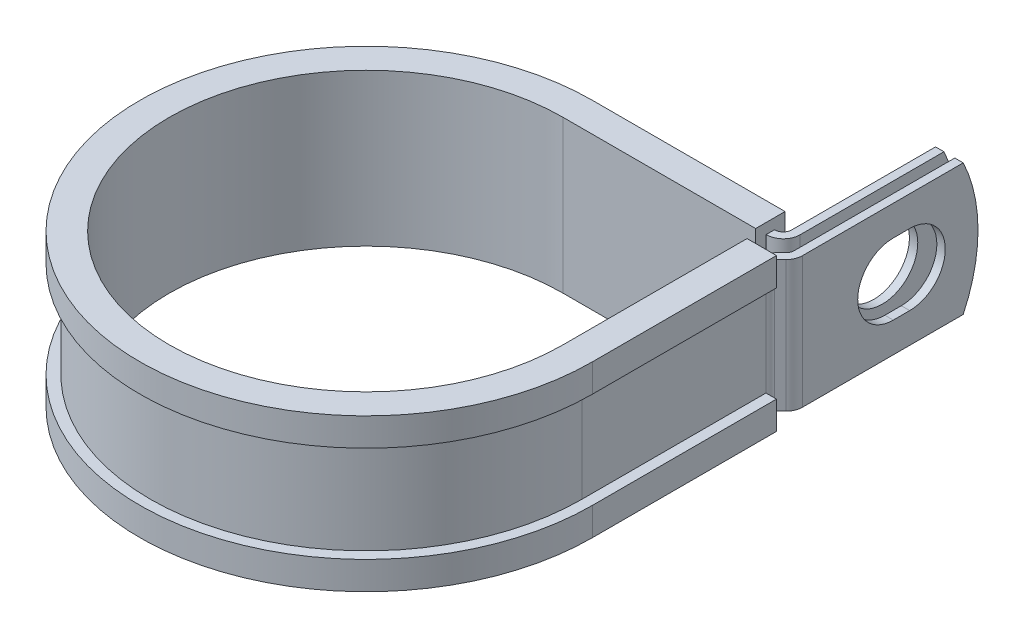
ISO-10303-21;
HEADER;
FILE_DESCRIPTION(('STEP AP214'),'2;1');
FILE_NAME('part.step','',(''),(''),'','','');
FILE_SCHEMA(('AUTOMOTIVE_DESIGN { 1 0 10303 214 1 1 1 1 }'));
ENDSEC;
DATA;
#1=APPLICATION_CONTEXT('core data for automotive mechanical design processes');
#2=APPLICATION_PROTOCOL_DEFINITION('international standard','automotive_design',2000,#1);
#3=PRODUCT_CONTEXT('',#1,'mechanical');
#4=PRODUCT('Part','Part','',(#3));
#5=PRODUCT_RELATED_PRODUCT_CATEGORY('part','',(#4));
#6=PRODUCT_DEFINITION_FORMATION('','',#4);
#7=PRODUCT_DEFINITION_CONTEXT('part definition',#1,'design');
#8=PRODUCT_DEFINITION('design','',#6,#7);
#9=PRODUCT_DEFINITION_SHAPE('','',#8);
#10=(LENGTH_UNIT() NAMED_UNIT(*) SI_UNIT(.MILLI.,.METRE.));
#11=(NAMED_UNIT(*) PLANE_ANGLE_UNIT() SI_UNIT($,.RADIAN.));
#12=(NAMED_UNIT(*) SI_UNIT($,.STERADIAN.) SOLID_ANGLE_UNIT());
#13=UNCERTAINTY_MEASURE_WITH_UNIT(LENGTH_MEASURE(1.E-05),#10,'distance_accuracy_value','');
#14=(GEOMETRIC_REPRESENTATION_CONTEXT(3) GLOBAL_UNCERTAINTY_ASSIGNED_CONTEXT((#13)) GLOBAL_UNIT_ASSIGNED_CONTEXT((#10,
#11,#12)) REPRESENTATION_CONTEXT('',''));
#15=CARTESIAN_POINT('',(0.,0.,0.));
#16=DIRECTION('',(0.,0.,1.));
#17=DIRECTION('',(1.,0.,0.));
#18=AXIS2_PLACEMENT_3D('',#15,#16,#17);
#19=CARTESIAN_POINT('',(30.7772698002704,-9.525,-30.099));
#20=DIRECTION('',(0.,1.,0.));
#21=DIRECTION('',(1.,0.,0.));
#22=AXIS2_PLACEMENT_3D('',#19,#20,#21);
#23=PLANE('',#22);
#24=DIRECTION('',(0.,0.,-1.));
#25=VECTOR('',#24,1.);
#26=CARTESIAN_POINT('',(27.9324698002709,-9.525,-30.099));
#27=LINE('',#26,#25);
#28=CARTESIAN_POINT('',(27.9324698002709,-9.525,-30.099));
#29=VERTEX_POINT('',#28);
#30=CARTESIAN_POINT('',(27.9324698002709,-9.525,-31.3182));
#31=VERTEX_POINT('',#30);
#32=EDGE_CURVE('E524',#29,#31,#27,.T.);
#33=ORIENTED_EDGE('',*,*,#32,.T.);
#34=DIRECTION('',(1.,0.,0.));
#35=VECTOR('',#34,1.);
#36=CARTESIAN_POINT('',(0.,-9.525,-31.3182));
#37=LINE('',#36,#35);
#38=CARTESIAN_POINT('',(27.9832698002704,-9.525,-31.3182));
#39=VERTEX_POINT('',#38);
#40=EDGE_CURVE('E411',#39,#31,#37,.F.);
#41=ORIENTED_EDGE('',*,*,#40,.F.);
#42=CARTESIAN_POINT('',(27.9832698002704,-9.525,-32.5374));
#43=DIRECTION('',(0.,1.,0.));
#44=DIRECTION('',(1.,0.,0.));
#45=AXIS2_PLACEMENT_3D('',#42,#43,#44);
#46=CIRCLE('',#45,1.2192);
#47=CARTESIAN_POINT('',(29.2024698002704,-9.525,-32.5374));
#48=VERTEX_POINT('',#47);
#49=EDGE_CURVE('E409',#48,#39,#46,.F.);
#50=ORIENTED_EDGE('',*,*,#49,.F.);
#51=DIRECTION('',(0.,0.,1.));
#52=VECTOR('',#51,1.);
#53=CARTESIAN_POINT('',(29.2024698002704,-9.525,-55.5498));
#54=LINE('',#53,#52);
#55=CARTESIAN_POINT('',(29.2024698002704,-9.525,-53.4052631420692));
#56=VERTEX_POINT('',#55);
#57=EDGE_CURVE('E407',#56,#48,#54,.T.);
#58=ORIENTED_EDGE('',*,*,#57,.F.);
#59=DIRECTION('',(-1.,0.,0.));
#60=VECTOR('',#59,1.);
#61=CARTESIAN_POINT('',(33.2156698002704,-9.525,-53.4052631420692));
#62=LINE('',#61,#60);
#63=CARTESIAN_POINT('',(30.4216698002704,-9.525,-53.4052631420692));
#64=VERTEX_POINT('',#63);
#65=EDGE_CURVE('E12',#64,#56,#62,.T.);
#66=ORIENTED_EDGE('',*,*,#65,.F.);
#67=DIRECTION('',(0.,0.,1.));
#68=VECTOR('',#67,1.);
#69=CARTESIAN_POINT('',(30.4216698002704,-9.525,-55.5498));
#70=LINE('',#69,#68);
#71=CARTESIAN_POINT('',(30.4216698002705,-9.525,-32.5374));
#72=VERTEX_POINT('',#71);
#73=EDGE_CURVE('E405',#64,#72,#70,.T.);
#74=ORIENTED_EDGE('',*,*,#73,.T.);
#75=CARTESIAN_POINT('',(27.9832698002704,-9.525,-32.5374));
#76=DIRECTION('',(0.,-1.,0.));
#77=DIRECTION('',(0.,0.,1.));
#78=AXIS2_PLACEMENT_3D('',#75,#76,#77);
#79=CIRCLE('',#78,2.4384);
#80=CARTESIAN_POINT('',(27.9832698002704,-9.525,-30.099));
#81=VERTEX_POINT('',#80);
#82=EDGE_CURVE('E402',#72,#81,#79,.T.);
#83=ORIENTED_EDGE('',*,*,#82,.T.);
#84=DIRECTION('',(-1.,0.,0.));
#85=VECTOR('',#84,1.);
#86=CARTESIAN_POINT('',(0.,-9.525,-30.099));
#87=LINE('',#86,#85);
#88=EDGE_CURVE('E399',#81,#29,#87,.T.);
#89=ORIENTED_EDGE('',*,*,#88,.T.);
#90=EDGE_LOOP('',(#33,#41,#50,#58,#66,#74,#83,#89));
#91=FACE_BOUND('',#90,.T.);
#92=ADVANCED_FACE('F55',(#91),#23,.F.);
#93=CARTESIAN_POINT('',(30.7772698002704,9.525,-30.099));
#94=DIRECTION('',(0.,1.,0.));
#95=DIRECTION('',(1.,0.,0.));
#96=AXIS2_PLACEMENT_3D('',#93,#94,#95);
#97=PLANE('',#96);
#98=DIRECTION('',(1.,0.,0.));
#99=VECTOR('',#98,1.);
#100=CARTESIAN_POINT('',(0.,9.525,-31.3182));
#101=LINE('',#100,#99);
#102=CARTESIAN_POINT('',(27.9832698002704,9.525,-31.3182));
#103=VERTEX_POINT('',#102);
#104=CARTESIAN_POINT('',(27.9324698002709,9.525,-31.3182));
#105=VERTEX_POINT('',#104);
#106=EDGE_CURVE('E369',#103,#105,#101,.F.);
#107=ORIENTED_EDGE('',*,*,#106,.T.);
#108=DIRECTION('',(0.,0.,1.));
#109=VECTOR('',#108,1.);
#110=CARTESIAN_POINT('',(27.9324698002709,9.525,-31.3182));
#111=LINE('',#110,#109);
#112=CARTESIAN_POINT('',(27.9324698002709,9.525,-30.099));
#113=VERTEX_POINT('',#112);
#114=EDGE_CURVE('E518',#105,#113,#111,.T.);
#115=ORIENTED_EDGE('',*,*,#114,.T.);
#116=DIRECTION('',(-1.,0.,0.));
#117=VECTOR('',#116,1.);
#118=CARTESIAN_POINT('',(0.,9.525,-30.099));
#119=LINE('',#118,#117);
#120=CARTESIAN_POINT('',(27.9832698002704,9.525,-30.099));
#121=VERTEX_POINT('',#120);
#122=EDGE_CURVE('E626',#121,#113,#119,.T.);
#123=ORIENTED_EDGE('',*,*,#122,.F.);
#124=CARTESIAN_POINT('',(27.9832698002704,9.525,-32.5374));
#125=DIRECTION('',(0.,-1.,0.));
#126=DIRECTION('',(0.,0.,1.));
#127=AXIS2_PLACEMENT_3D('',#124,#125,#126);
#128=CIRCLE('',#127,2.4384);
#129=CARTESIAN_POINT('',(30.4216698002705,9.525,-32.5374));
#130=VERTEX_POINT('',#129);
#131=EDGE_CURVE('E371',#130,#121,#128,.T.);
#132=ORIENTED_EDGE('',*,*,#131,.F.);
#133=DIRECTION('',(0.,0.,1.));
#134=VECTOR('',#133,1.);
#135=CARTESIAN_POINT('',(30.4216698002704,9.525,-55.5498));
#136=LINE('',#135,#134);
#137=CARTESIAN_POINT('',(30.4216698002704,9.525,-53.4052631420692));
#138=VERTEX_POINT('',#137);
#139=EDGE_CURVE('E362',#138,#130,#136,.T.);
#140=ORIENTED_EDGE('',*,*,#139,.F.);
#141=DIRECTION('',(-1.,0.,0.));
#142=VECTOR('',#141,1.);
#143=CARTESIAN_POINT('',(33.2156698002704,9.525,-53.4052631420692));
#144=LINE('',#143,#142);
#145=CARTESIAN_POINT('',(29.2024698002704,9.525,-53.4052631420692));
#146=VERTEX_POINT('',#145);
#147=EDGE_CURVE('E63',#138,#146,#144,.T.);
#148=ORIENTED_EDGE('',*,*,#147,.T.);
#149=DIRECTION('',(0.,0.,1.));
#150=VECTOR('',#149,1.);
#151=CARTESIAN_POINT('',(29.2024698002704,9.525,-55.5498));
#152=LINE('',#151,#150);
#153=CARTESIAN_POINT('',(29.2024698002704,9.525,-32.5374));
#154=VERTEX_POINT('',#153);
#155=EDGE_CURVE('E359',#146,#154,#152,.T.);
#156=ORIENTED_EDGE('',*,*,#155,.T.);
#157=CARTESIAN_POINT('',(27.9832698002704,9.525,-32.5374));
#158=DIRECTION('',(0.,1.,0.));
#159=DIRECTION('',(1.,0.,0.));
#160=AXIS2_PLACEMENT_3D('',#157,#158,#159);
#161=CIRCLE('',#160,1.2192);
#162=EDGE_CURVE('E367',#154,#103,#161,.F.);
#163=ORIENTED_EDGE('',*,*,#162,.T.);
#164=EDGE_LOOP('',(#107,#115,#123,#132,#140,#148,#156,#163));
#165=FACE_BOUND('',#164,.T.);
#166=ADVANCED_FACE('F358',(#165),#97,.T.);
#167=CARTESIAN_POINT('',(0.,9.525,-30.099));
#168=DIRECTION('',(0.,0.,1.));
#169=DIRECTION('',(1.,0.,0.));
#170=AXIS2_PLACEMENT_3D('',#167,#168,#169);
#171=PLANE('',#170);
#172=ORIENTED_EDGE('',*,*,#122,.T.);
#173=DIRECTION('',(0.,-1.,0.));
#174=VECTOR('',#173,1.);
#175=CARTESIAN_POINT('',(27.9324698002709,9.525,-30.099));
#176=LINE('',#175,#174);
#177=EDGE_CURVE('E521',#113,#29,#176,.T.);
#178=ORIENTED_EDGE('',*,*,#177,.T.);
#179=ORIENTED_EDGE('',*,*,#88,.F.);
#180=DIRECTION('',(0.,-1.,0.));
#181=VECTOR('',#180,1.);
#182=CARTESIAN_POINT('',(27.9832698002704,9.525,-30.099));
#183=LINE('',#182,#181);
#184=EDGE_CURVE('E345',#121,#81,#183,.T.);
#185=ORIENTED_EDGE('',*,*,#184,.F.);
#186=EDGE_LOOP('',(#172,#178,#179,#185));
#187=FACE_BOUND('',#186,.T.);
#188=ADVANCED_FACE('F636',(#187),#171,.T.);
#189=CARTESIAN_POINT('',(33.2156698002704,9.525,-30.099));
#190=DIRECTION('',(-1.,0.,0.));
#191=DIRECTION('',(0.,0.,1.));
#192=AXIS2_PLACEMENT_3D('',#189,#190,#191);
#193=PLANE('',#192);
#194=CARTESIAN_POINT('',(33.2156698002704,0.,-45.6437999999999));
#195=DIRECTION('',(1.,0.,0.));
#196=DIRECTION('',(0.,0.,-1.));
#197=AXIS2_PLACEMENT_3D('',#194,#195,#196);
#198=CIRCLE('',#197,5.1562);
#199=CARTESIAN_POINT('',(33.2156698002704,-5.1562,-45.6438000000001));
#200=VERTEX_POINT('',#199);
#201=CARTESIAN_POINT('',(33.2156698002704,5.1562,-45.6438000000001));
#202=VERTEX_POINT('',#201);
#203=EDGE_CURVE('E581',#200,#202,#198,.T.);
#204=ORIENTED_EDGE('',*,*,#203,.F.);
#205=DIRECTION('',(0.,0.,-1.));
#206=VECTOR('',#205,1.);
#207=CARTESIAN_POINT('',(33.2156698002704,-5.1562,-43.2561999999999));
#208=LINE('',#207,#206);
#209=CARTESIAN_POINT('',(33.2156698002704,-5.1562,-43.2561999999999));
#210=VERTEX_POINT('',#209);
#211=EDGE_CURVE('E584',#210,#200,#208,.T.);
#212=ORIENTED_EDGE('',*,*,#211,.F.);
#213=CARTESIAN_POINT('',(33.2156698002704,0.,-43.2561999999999));
#214=DIRECTION('',(1.,0.,0.));
#215=DIRECTION('',(0.,0.,-1.));
#216=AXIS2_PLACEMENT_3D('',#213,#214,#215);
#217=CIRCLE('',#216,5.1562);
#218=CARTESIAN_POINT('',(33.2156698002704,5.1562,-43.2561999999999));
#219=VERTEX_POINT('',#218);
#220=EDGE_CURVE('E577',#219,#210,#217,.T.);
#221=ORIENTED_EDGE('',*,*,#220,.F.);
#222=DIRECTION('',(0.,0.,1.));
#223=VECTOR('',#222,1.);
#224=CARTESIAN_POINT('',(33.2156698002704,5.1562,-43.2561999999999));
#225=LINE('',#224,#223);
#226=EDGE_CURVE('E578',#202,#219,#225,.T.);
#227=ORIENTED_EDGE('',*,*,#226,.F.);
#228=EDGE_LOOP('',(#204,#212,#221,#227));
#229=FACE_BOUND('',#228,.T.);
#230=DIRECTION('',(0.,0.,-1.));
#231=VECTOR('',#230,1.);
#232=CARTESIAN_POINT('',(33.2156698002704,-9.525,-30.099));
#233=LINE('',#232,#231);
#234=CARTESIAN_POINT('',(33.2156698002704,-9.525,-30.099));
#235=VERTEX_POINT('',#234);
#236=CARTESIAN_POINT('',(33.2156698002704,-9.525,-53.4052631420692));
#237=VERTEX_POINT('',#236);
#238=EDGE_CURVE('E383',#235,#237,#233,.T.);
#239=ORIENTED_EDGE('',*,*,#238,.T.);
#240=CARTESIAN_POINT('',(33.2156698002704,0.,-33.3248));
#241=DIRECTION('',(-1.,0.,0.));
#242=DIRECTION('',(0.,0.,1.));
#243=AXIS2_PLACEMENT_3D('',#240,#241,#242);
#244=CIRCLE('',#243,22.225);
#245=CARTESIAN_POINT('',(33.2156698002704,9.525,-53.4052631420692));
#246=VERTEX_POINT('',#245);
#247=EDGE_CURVE('E569',#246,#237,#244,.T.);
#248=ORIENTED_EDGE('',*,*,#247,.F.);
#249=DIRECTION('',(0.,0.,-1.));
#250=VECTOR('',#249,1.);
#251=CARTESIAN_POINT('',(33.2156698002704,9.525,-30.099));
#252=LINE('',#251,#250);
#253=CARTESIAN_POINT('',(33.2156698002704,9.525,-30.099));
#254=VERTEX_POINT('',#253);
#255=EDGE_CURVE('E420',#254,#246,#252,.T.);
#256=ORIENTED_EDGE('',*,*,#255,.F.);
#257=DIRECTION('',(0.,-1.,0.));
#258=VECTOR('',#257,1.);
#259=CARTESIAN_POINT('',(33.2156698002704,9.525,-30.099));
#260=LINE('',#259,#258);
#261=EDGE_CURVE('E382',#254,#235,#260,.T.);
#262=ORIENTED_EDGE('',*,*,#261,.T.);
#263=EDGE_LOOP('',(#239,#248,#256,#262));
#264=FACE_BOUND('',#263,.T.);
#265=ADVANCED_FACE('F57',(#229,#264),#193,.F.);
#266=CARTESIAN_POINT('',(31.9964698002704,9.525,-30.099));
#267=DIRECTION('',(-1.,0.,0.));
#268=DIRECTION('',(0.,0.,1.));
#269=AXIS2_PLACEMENT_3D('',#266,#267,#268);
#270=PLANE('',#269);
#271=DIRECTION('',(0.,0.,-1.));
#272=VECTOR('',#271,1.);
#273=CARTESIAN_POINT('',(31.9964698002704,-5.1562,-43.2561999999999));
#274=LINE('',#273,#272);
#275=CARTESIAN_POINT('',(31.9964698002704,-5.1562,-43.2561999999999));
#276=VERTEX_POINT('',#275);
#277=CARTESIAN_POINT('',(31.9964698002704,-5.1562,-45.6438000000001));
#278=VERTEX_POINT('',#277);
#279=EDGE_CURVE('E580',#276,#278,#274,.T.);
#280=ORIENTED_EDGE('',*,*,#279,.T.);
#281=CARTESIAN_POINT('',(31.9964698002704,0.,-45.6437999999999));
#282=DIRECTION('',(-1.,0.,0.));
#283=DIRECTION('',(0.,0.,1.));
#284=AXIS2_PLACEMENT_3D('',#281,#282,#283);
#285=CIRCLE('',#284,5.1562);
#286=CARTESIAN_POINT('',(31.9964698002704,5.1562,-45.6438000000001));
#287=VERTEX_POINT('',#286);
#288=EDGE_CURVE('E601',#278,#287,#285,.F.);
#289=ORIENTED_EDGE('',*,*,#288,.T.);
#290=DIRECTION('',(0.,0.,1.));
#291=VECTOR('',#290,1.);
#292=CARTESIAN_POINT('',(31.9964698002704,5.1562,-43.2561999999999));
#293=LINE('',#292,#291);
#294=CARTESIAN_POINT('',(31.9964698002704,5.1562,-43.2561999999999));
#295=VERTEX_POINT('',#294);
#296=EDGE_CURVE('E597',#287,#295,#293,.T.);
#297=ORIENTED_EDGE('',*,*,#296,.T.);
#298=CARTESIAN_POINT('',(31.9964698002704,0.,-43.2561999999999));
#299=DIRECTION('',(-1.,0.,0.));
#300=DIRECTION('',(0.,0.,1.));
#301=AXIS2_PLACEMENT_3D('',#298,#299,#300);
#302=CIRCLE('',#301,5.1562);
#303=EDGE_CURVE('E592',#295,#276,#302,.F.);
#304=ORIENTED_EDGE('',*,*,#303,.T.);
#305=EDGE_LOOP('',(#280,#289,#297,#304));
#306=FACE_BOUND('',#305,.T.);
#307=CARTESIAN_POINT('',(31.9964698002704,0.,-33.3248));
#308=DIRECTION('',(-1.,0.,0.));
#309=DIRECTION('',(0.,0.,1.));
#310=AXIS2_PLACEMENT_3D('',#307,#308,#309);
#311=CIRCLE('',#310,22.225);
#312=CARTESIAN_POINT('',(31.9964698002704,9.525,-53.4052631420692));
#313=VERTEX_POINT('',#312);
#314=CARTESIAN_POINT('',(31.9964698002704,-9.525,-53.4052631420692));
#315=VERTEX_POINT('',#314);
#316=EDGE_CURVE('E77',#313,#315,#311,.T.);
#317=ORIENTED_EDGE('',*,*,#316,.T.);
#318=DIRECTION('',(0.,0.,-1.));
#319=VECTOR('',#318,1.);
#320=CARTESIAN_POINT('',(31.9964698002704,-9.525,-30.099));
#321=LINE('',#320,#319);
#322=CARTESIAN_POINT('',(31.9964698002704,-9.525,-30.099));
#323=VERTEX_POINT('',#322);
#324=EDGE_CURVE('E386',#323,#315,#321,.T.);
#325=ORIENTED_EDGE('',*,*,#324,.F.);
#326=DIRECTION('',(0.,-1.,0.));
#327=VECTOR('',#326,1.);
#328=CARTESIAN_POINT('',(31.9964698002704,9.525,-30.099));
#329=LINE('',#328,#327);
#330=CARTESIAN_POINT('',(31.9964698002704,9.525,-30.099));
#331=VERTEX_POINT('',#330);
#332=EDGE_CURVE('E353',#331,#323,#329,.T.);
#333=ORIENTED_EDGE('',*,*,#332,.F.);
#334=DIRECTION('',(0.,0.,-1.));
#335=VECTOR('',#334,1.);
#336=CARTESIAN_POINT('',(31.9964698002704,9.525,-30.099));
#337=LINE('',#336,#335);
#338=EDGE_CURVE('E616',#331,#313,#337,.T.);
#339=ORIENTED_EDGE('',*,*,#338,.T.);
#340=EDGE_LOOP('',(#317,#325,#333,#339));
#341=FACE_BOUND('',#340,.T.);
#342=ADVANCED_FACE('F690',(#306,#341),#270,.T.);
#343=CARTESIAN_POINT('',(30.4216698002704,9.525,-55.5498));
#344=DIRECTION('',(1.,0.,0.));
#345=DIRECTION('',(0.,0.,-1.));
#346=AXIS2_PLACEMENT_3D('',#343,#344,#345);
#347=PLANE('',#346);
#348=CARTESIAN_POINT('',(30.4216698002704,0.,-44.45));
#349=DIRECTION('',(1.,0.,0.));
#350=DIRECTION('',(0.,0.,-1.));
#351=AXIS2_PLACEMENT_3D('',#348,#349,#350);
#352=CIRCLE('',#351,5.1562);
#353=CARTESIAN_POINT('',(30.4216698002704,0.,-49.6062));
#354=VERTEX_POINT('',#353);
#355=EDGE_CURVE('E387',#354,#354,#352,.F.);
#356=ORIENTED_EDGE('',*,*,#355,.T.);
#357=EDGE_LOOP('',(#356));
#358=FACE_BOUND('',#357,.T.);
#359=ORIENTED_EDGE('',*,*,#73,.F.);
#360=CARTESIAN_POINT('',(30.4216698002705,0.,-33.3248));
#361=DIRECTION('',(1.,0.,0.));
#362=DIRECTION('',(0.,0.,-1.));
#363=AXIS2_PLACEMENT_3D('',#360,#361,#362);
#364=CIRCLE('',#363,22.225);
#365=EDGE_CURVE('E574',#64,#138,#364,.T.);
#366=ORIENTED_EDGE('',*,*,#365,.T.);
#367=ORIENTED_EDGE('',*,*,#139,.T.);
#368=DIRECTION('',(0.,-1.,0.));
#369=VECTOR('',#368,1.);
#370=CARTESIAN_POINT('',(30.4216698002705,9.525,-32.5374));
#371=LINE('',#370,#369);
#372=EDGE_CURVE('E342',#130,#72,#371,.T.);
#373=ORIENTED_EDGE('',*,*,#372,.T.);
#374=EDGE_LOOP('',(#359,#366,#367,#373));
#375=FACE_BOUND('',#374,.T.);
#376=ADVANCED_FACE('F642',(#358,#375),#347,.T.);
#377=CARTESIAN_POINT('',(29.2024698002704,9.525,-55.5498));
#378=DIRECTION('',(1.,0.,0.));
#379=DIRECTION('',(0.,0.,-1.));
#380=AXIS2_PLACEMENT_3D('',#377,#378,#379);
#381=PLANE('',#380);
#382=CARTESIAN_POINT('',(29.2024698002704,0.,-44.45));
#383=DIRECTION('',(-1.,0.,0.));
#384=DIRECTION('',(0.,0.,1.));
#385=AXIS2_PLACEMENT_3D('',#382,#383,#384);
#386=CIRCLE('',#385,5.1562);
#387=CARTESIAN_POINT('',(29.2024698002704,0.,-39.2938));
#388=VERTEX_POINT('',#387);
#389=EDGE_CURVE('E609',#388,#388,#386,.T.);
#390=ORIENTED_EDGE('',*,*,#389,.F.);
#391=EDGE_LOOP('',(#390));
#392=FACE_BOUND('',#391,.T.);
#393=CARTESIAN_POINT('',(29.2024698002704,0.,-33.3248));
#394=DIRECTION('',(-1.,0.,0.));
#395=DIRECTION('',(0.,0.,1.));
#396=AXIS2_PLACEMENT_3D('',#393,#394,#395);
#397=CIRCLE('',#396,22.225);
#398=EDGE_CURVE('E69',#146,#56,#397,.T.);
#399=ORIENTED_EDGE('',*,*,#398,.T.);
#400=ORIENTED_EDGE('',*,*,#57,.T.);
#401=DIRECTION('',(0.,-1.,0.));
#402=VECTOR('',#401,1.);
#403=CARTESIAN_POINT('',(29.2024698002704,9.525,-32.5374));
#404=LINE('',#403,#402);
#405=EDGE_CURVE('E339',#154,#48,#404,.T.);
#406=ORIENTED_EDGE('',*,*,#405,.F.);
#407=ORIENTED_EDGE('',*,*,#155,.F.);
#408=EDGE_LOOP('',(#399,#400,#406,#407));
#409=FACE_BOUND('',#408,.T.);
#410=ADVANCED_FACE('F365',(#392,#409),#381,.F.);
#411=CARTESIAN_POINT('',(32.5374,-9.525,-26.6865026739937));
#412=DIRECTION('',(0.,1.,0.));
#413=DIRECTION('',(1.,0.,0.));
#414=AXIS2_PLACEMENT_3D('',#411,#412,#413);
#415=CIRCLE('',#414,1.2192);
#416=CARTESIAN_POINT('',(31.3182,-9.525,-26.6865026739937));
#417=VERTEX_POINT('',#416);
#418=CARTESIAN_POINT('',(31.6752954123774,-9.525,-27.5486072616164));
#419=VERTEX_POINT('',#418);
#420=EDGE_CURVE('E414',#417,#419,#415,.F.);
#421=ORIENTED_EDGE('',*,*,#420,.F.);
#422=DIRECTION('',(1.,0.,0.));
#423=VECTOR('',#422,1.);
#424=CARTESIAN_POINT('',(30.099,-9.525,-26.6865026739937));
#425=LINE('',#424,#423);
#426=CARTESIAN_POINT('',(30.099,-9.525,-26.6865026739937));
#427=VERTEX_POINT('',#426);
#428=EDGE_CURVE('E452',#427,#417,#425,.T.);
#429=ORIENTED_EDGE('',*,*,#428,.F.);
#430=CARTESIAN_POINT('',(32.5374,-9.525,-26.6865026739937));
#431=DIRECTION('',(0.,-1.,0.));
#432=DIRECTION('',(0.,0.,1.));
#433=AXIS2_PLACEMENT_3D('',#430,#431,#432);
#434=CIRCLE('',#433,2.4384);
#435=CARTESIAN_POINT('',(30.8131908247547,-9.525,-28.410711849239));
#436=VERTEX_POINT('',#435);
#437=EDGE_CURVE('E396',#427,#436,#434,.T.);
#438=ORIENTED_EDGE('',*,*,#437,.T.);
#439=DIRECTION('',(0.707106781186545,0.,-0.70710678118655));
#440=VECTOR('',#439,1.);
#441=CARTESIAN_POINT('',(30.8131908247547,-9.525,-28.410711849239));
#442=LINE('',#441,#440);
#443=CARTESIAN_POINT('',(31.6393743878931,-9.525,-29.2368954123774));
#444=VERTEX_POINT('',#443);
#445=EDGE_CURVE('E393',#436,#444,#442,.T.);
#446=ORIENTED_EDGE('',*,*,#445,.T.);
#447=CARTESIAN_POINT('',(30.7772698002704,-9.525,-30.099));
#448=DIRECTION('',(0.,1.,0.));
#449=DIRECTION('',(0.,0.,1.));
#450=AXIS2_PLACEMENT_3D('',#447,#448,#449);
#451=CIRCLE('',#450,1.2192);
#452=EDGE_CURVE('E390',#444,#323,#451,.T.);
#453=ORIENTED_EDGE('',*,*,#452,.T.);
#454=ORIENTED_EDGE('',*,*,#324,.T.);
#455=DIRECTION('',(-1.,0.,0.));
#456=VECTOR('',#455,1.);
#457=CARTESIAN_POINT('',(33.2156698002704,-9.525,-53.4052631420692));
#458=LINE('',#457,#456);
#459=EDGE_CURVE('E567',#237,#315,#458,.T.);
#460=ORIENTED_EDGE('',*,*,#459,.F.);
#461=ORIENTED_EDGE('',*,*,#238,.F.);
#462=CARTESIAN_POINT('',(30.7772698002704,-9.525,-30.099));
#463=DIRECTION('',(0.,1.,0.));
#464=DIRECTION('',(1.,0.,0.));
#465=AXIS2_PLACEMENT_3D('',#462,#463,#464);
#466=CIRCLE('',#465,2.4384);
#467=CARTESIAN_POINT('',(32.5014789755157,-9.525,-28.3747908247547));
#468=VERTEX_POINT('',#467);
#469=EDGE_CURVE('E418',#468,#235,#466,.T.);
#470=ORIENTED_EDGE('',*,*,#469,.F.);
#471=DIRECTION('',(0.707106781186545,0.,-0.70710678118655));
#472=VECTOR('',#471,1.);
#473=CARTESIAN_POINT('',(31.6752954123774,-9.525,-27.5486072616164));
#474=LINE('',#473,#472);
#475=EDGE_CURVE('E416',#419,#468,#474,.T.);
#476=ORIENTED_EDGE('',*,*,#475,.F.);
#477=EDGE_LOOP('',(#421,#429,#438,#446,#453,#454,#460,#461,#470,#476));
#478=FACE_BOUND('',#477,.T.);
#479=ADVANCED_FACE('F676',(#478),#23,.F.);
#480=DIRECTION('',(-1.,0.,0.));
#481=VECTOR('',#480,1.);
#482=CARTESIAN_POINT('',(31.3182,9.525,-26.6865026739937));
#483=LINE('',#482,#481);
#484=CARTESIAN_POINT('',(31.3182,9.525,-26.6865026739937));
#485=VERTEX_POINT('',#484);
#486=CARTESIAN_POINT('',(30.099,9.525,-26.6865026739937));
#487=VERTEX_POINT('',#486);
#488=EDGE_CURVE('E441',#485,#487,#483,.T.);
#489=ORIENTED_EDGE('',*,*,#488,.F.);
#490=CARTESIAN_POINT('',(32.5374,9.525,-26.6865026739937));
#491=DIRECTION('',(0.,1.,0.));
#492=DIRECTION('',(1.,0.,0.));
#493=AXIS2_PLACEMENT_3D('',#490,#491,#492);
#494=CIRCLE('',#493,1.2192);
#495=CARTESIAN_POINT('',(31.6752954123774,9.525,-27.5486072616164));
#496=VERTEX_POINT('',#495);
#497=EDGE_CURVE('E376',#485,#496,#494,.F.);
#498=ORIENTED_EDGE('',*,*,#497,.T.);
#499=DIRECTION('',(0.707106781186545,0.,-0.70710678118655));
#500=VECTOR('',#499,1.);
#501=CARTESIAN_POINT('',(31.6752954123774,9.525,-27.5486072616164));
#502=LINE('',#501,#500);
#503=CARTESIAN_POINT('',(32.5014789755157,9.525,-28.3747908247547));
#504=VERTEX_POINT('',#503);
#505=EDGE_CURVE('E378',#496,#504,#502,.T.);
#506=ORIENTED_EDGE('',*,*,#505,.T.);
#507=CARTESIAN_POINT('',(30.7772698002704,9.525,-30.099));
#508=DIRECTION('',(0.,1.,0.));
#509=DIRECTION('',(1.,0.,0.));
#510=AXIS2_PLACEMENT_3D('',#507,#508,#509);
#511=CIRCLE('',#510,2.4384);
#512=EDGE_CURVE('E380',#504,#254,#511,.T.);
#513=ORIENTED_EDGE('',*,*,#512,.T.);
#514=ORIENTED_EDGE('',*,*,#255,.T.);
#515=DIRECTION('',(-1.,0.,0.));
#516=VECTOR('',#515,1.);
#517=CARTESIAN_POINT('',(33.2156698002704,9.525,-53.4052631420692));
#518=LINE('',#517,#516);
#519=EDGE_CURVE('E571',#246,#313,#518,.T.);
#520=ORIENTED_EDGE('',*,*,#519,.T.);
#521=ORIENTED_EDGE('',*,*,#338,.F.);
#522=CARTESIAN_POINT('',(30.7772698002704,9.525,-30.099));
#523=DIRECTION('',(0.,1.,0.));
#524=DIRECTION('',(0.,0.,1.));
#525=AXIS2_PLACEMENT_3D('',#522,#523,#524);
#526=CIRCLE('',#525,1.2192);
#527=CARTESIAN_POINT('',(31.6393743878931,9.525,-29.2368954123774));
#528=VERTEX_POINT('',#527);
#529=EDGE_CURVE('E619',#528,#331,#526,.T.);
#530=ORIENTED_EDGE('',*,*,#529,.F.);
#531=DIRECTION('',(0.707106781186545,0.,-0.70710678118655));
#532=VECTOR('',#531,1.);
#533=CARTESIAN_POINT('',(30.8131908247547,9.525,-28.410711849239));
#534=LINE('',#533,#532);
#535=CARTESIAN_POINT('',(30.8131908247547,9.525,-28.410711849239));
#536=VERTEX_POINT('',#535);
#537=EDGE_CURVE('E622',#536,#528,#534,.T.);
#538=ORIENTED_EDGE('',*,*,#537,.F.);
#539=CARTESIAN_POINT('',(32.5374,9.525,-26.6865026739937));
#540=DIRECTION('',(0.,-1.,0.));
#541=DIRECTION('',(0.,0.,1.));
#542=AXIS2_PLACEMENT_3D('',#539,#540,#541);
#543=CIRCLE('',#542,2.4384);
#544=EDGE_CURVE('E451',#487,#536,#543,.T.);
#545=ORIENTED_EDGE('',*,*,#544,.F.);
#546=EDGE_LOOP('',(#489,#498,#506,#513,#514,#520,#521,#530,#538,#545));
#547=FACE_BOUND('',#546,.T.);
#548=ADVANCED_FACE('F448',(#547),#97,.T.);
#549=CARTESIAN_POINT('',(30.7772698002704,9.525,-30.099));
#550=DIRECTION('',(0.,-1.,0.));
#551=DIRECTION('',(0.,0.,-1.));
#552=AXIS2_PLACEMENT_3D('',#549,#550,#551);
#553=CYLINDRICAL_SURFACE('',#552,1.2192);
#554=ORIENTED_EDGE('',*,*,#452,.F.);
#555=DIRECTION('',(0.,-1.,0.));
#556=VECTOR('',#555,1.);
#557=CARTESIAN_POINT('',(31.6393743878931,9.525,-29.2368954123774));
#558=LINE('',#557,#556);
#559=EDGE_CURVE('E351',#528,#444,#558,.T.);
#560=ORIENTED_EDGE('',*,*,#559,.F.);
#561=ORIENTED_EDGE('',*,*,#529,.T.);
#562=ORIENTED_EDGE('',*,*,#332,.T.);
#563=EDGE_LOOP('',(#554,#560,#561,#562));
#564=FACE_BOUND('',#563,.T.);
#565=ADVANCED_FACE('F686',(#564),#553,.F.);
#566=CARTESIAN_POINT('',(30.8131908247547,9.525,-28.410711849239));
#567=DIRECTION('',(-0.70710678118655,0.,-0.707106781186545));
#568=DIRECTION('',(-0.707106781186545,0.,0.70710678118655));
#569=AXIS2_PLACEMENT_3D('',#566,#567,#568);
#570=PLANE('',#569);
#571=ORIENTED_EDGE('',*,*,#445,.F.);
#572=DIRECTION('',(0.,-1.,0.));
#573=VECTOR('',#572,1.);
#574=CARTESIAN_POINT('',(30.8131908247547,9.525,-28.410711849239));
#575=LINE('',#574,#573);
#576=EDGE_CURVE('E349',#536,#436,#575,.T.);
#577=ORIENTED_EDGE('',*,*,#576,.F.);
#578=ORIENTED_EDGE('',*,*,#537,.T.);
#579=ORIENTED_EDGE('',*,*,#559,.T.);
#580=EDGE_LOOP('',(#571,#577,#578,#579));
#581=FACE_BOUND('',#580,.T.);
#582=ADVANCED_FACE('F681',(#581),#570,.T.);
#583=CARTESIAN_POINT('',(32.5374,9.525,-26.6865026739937));
#584=DIRECTION('',(0.,-1.,0.));
#585=DIRECTION('',(0.,0.,-1.));
#586=AXIS2_PLACEMENT_3D('',#583,#584,#585);
#587=CYLINDRICAL_SURFACE('',#586,2.4384);
#588=ORIENTED_EDGE('',*,*,#437,.F.);
#589=DIRECTION('',(0.,-1.,0.));
#590=VECTOR('',#589,1.);
#591=CARTESIAN_POINT('',(30.099,9.525,-26.6865026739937));
#592=LINE('',#591,#590);
#593=EDGE_CURVE('E347',#487,#427,#592,.T.);
#594=ORIENTED_EDGE('',*,*,#593,.F.);
#595=ORIENTED_EDGE('',*,*,#544,.T.);
#596=ORIENTED_EDGE('',*,*,#576,.T.);
#597=EDGE_LOOP('',(#588,#594,#595,#596));
#598=FACE_BOUND('',#597,.T.);
#599=ADVANCED_FACE('F678',(#598),#587,.T.);
#600=CARTESIAN_POINT('',(27.9832698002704,9.525,-32.5374));
#601=DIRECTION('',(0.,-1.,0.));
#602=DIRECTION('',(0.,0.,-1.));
#603=AXIS2_PLACEMENT_3D('',#600,#601,#602);
#604=CYLINDRICAL_SURFACE('',#603,2.4384);
#605=ORIENTED_EDGE('',*,*,#82,.F.);
#606=ORIENTED_EDGE('',*,*,#372,.F.);
#607=ORIENTED_EDGE('',*,*,#131,.T.);
#608=ORIENTED_EDGE('',*,*,#184,.T.);
#609=EDGE_LOOP('',(#605,#606,#607,#608));
#610=FACE_BOUND('',#609,.T.);
#611=ADVANCED_FACE('F632',(#610),#604,.T.);
#612=CARTESIAN_POINT('',(27.9832698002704,9.525,-32.5374));
#613=DIRECTION('',(0.,-1.,0.));
#614=DIRECTION('',(0.,0.,-1.));
#615=AXIS2_PLACEMENT_3D('',#612,#613,#614);
#616=CYLINDRICAL_SURFACE('',#615,1.2192);
#617=ORIENTED_EDGE('',*,*,#49,.T.);
#618=DIRECTION('',(0.,-1.,0.));
#619=VECTOR('',#618,1.);
#620=CARTESIAN_POINT('',(27.9832698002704,9.525,-31.3182));
#621=LINE('',#620,#619);
#622=EDGE_CURVE('E330',#103,#39,#621,.T.);
#623=ORIENTED_EDGE('',*,*,#622,.F.);
#624=ORIENTED_EDGE('',*,*,#162,.F.);
#625=ORIENTED_EDGE('',*,*,#405,.T.);
#626=EDGE_LOOP('',(#617,#623,#624,#625));
#627=FACE_BOUND('',#626,.T.);
#628=ADVANCED_FACE('F647',(#627),#616,.F.);
#629=CARTESIAN_POINT('',(0.,9.525,-31.3182));
#630=DIRECTION('',(0.,0.,1.));
#631=DIRECTION('',(1.,0.,0.));
#632=AXIS2_PLACEMENT_3D('',#629,#630,#631);
#633=PLANE('',#632);
#634=DIRECTION('',(0.,-1.,0.));
#635=VECTOR('',#634,1.);
#636=CARTESIAN_POINT('',(0.,9.525,-31.3182));
#637=LINE('',#636,#635);
#638=CARTESIAN_POINT('',(4.39305330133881E-13,6.985,-31.3182));
#639=VERTEX_POINT('',#638);
#640=CARTESIAN_POINT('',(4.39305330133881E-13,-6.985,-31.3182));
#641=VERTEX_POINT('',#640);
#642=EDGE_CURVE('E321',#639,#641,#637,.T.);
#643=ORIENTED_EDGE('',*,*,#642,.F.);
#644=DIRECTION('',(1.,0.,0.));
#645=VECTOR('',#644,1.);
#646=CARTESIAN_POINT('',(4.39305330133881E-13,6.985,-31.3182));
#647=LINE('',#646,#645);
#648=CARTESIAN_POINT('',(27.9324698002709,6.985,-31.3182));
#649=VERTEX_POINT('',#648);
#650=EDGE_CURVE('E564',#639,#649,#647,.T.);
#651=ORIENTED_EDGE('',*,*,#650,.T.);
#652=DIRECTION('',(0.,1.,0.));
#653=VECTOR('',#652,1.);
#654=CARTESIAN_POINT('',(27.9324698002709,9.525,-31.3182));
#655=LINE('',#654,#653);
#656=EDGE_CURVE('E515',#649,#105,#655,.T.);
#657=ORIENTED_EDGE('',*,*,#656,.T.);
#658=ORIENTED_EDGE('',*,*,#106,.F.);
#659=ORIENTED_EDGE('',*,*,#622,.T.);
#660=ORIENTED_EDGE('',*,*,#40,.T.);
#661=DIRECTION('',(0.,1.,0.));
#662=VECTOR('',#661,1.);
#663=CARTESIAN_POINT('',(27.9324698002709,-9.525,-31.3182));
#664=LINE('',#663,#662);
#665=CARTESIAN_POINT('',(27.9324698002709,-6.985,-31.3182));
#666=VERTEX_POINT('',#665);
#667=EDGE_CURVE('E527',#31,#666,#664,.T.);
#668=ORIENTED_EDGE('',*,*,#667,.T.);
#669=DIRECTION('',(1.,0.,0.));
#670=VECTOR('',#669,1.);
#671=CARTESIAN_POINT('',(4.39305330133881E-13,-6.985,-31.3182));
#672=LINE('',#671,#670);
#673=EDGE_CURVE('E544',#641,#666,#672,.T.);
#674=ORIENTED_EDGE('',*,*,#673,.F.);
#675=EDGE_LOOP('',(#643,#651,#657,#658,#659,#660,#668,#674));
#676=FACE_BOUND('',#675,.T.);
#677=ADVANCED_FACE('F651',(#676),#633,.F.);
#678=CARTESIAN_POINT('',(0.,9.525,0.));
#679=DIRECTION('',(0.,-1.,0.));
#680=DIRECTION('',(0.,0.,-1.));
#681=AXIS2_PLACEMENT_3D('',#678,#679,#680);
#682=CYLINDRICAL_SURFACE('',#681,31.3182);
#683=DIRECTION('',(0.,-1.,0.));
#684=VECTOR('',#683,1.);
#685=CARTESIAN_POINT('',(31.3182,9.525,0.));
#686=LINE('',#685,#684);
#687=CARTESIAN_POINT('',(31.3182,6.985,0.));
#688=VERTEX_POINT('',#687);
#689=CARTESIAN_POINT('',(31.3182,-6.985,0.));
#690=VERTEX_POINT('',#689);
#691=EDGE_CURVE('E319',#688,#690,#686,.T.);
#692=ORIENTED_EDGE('',*,*,#691,.F.);
#693=CARTESIAN_POINT('',(0.,6.985,0.));
#694=DIRECTION('',(0.,-1.,0.));
#695=DIRECTION('',(0.,0.,-1.));
#696=AXIS2_PLACEMENT_3D('',#693,#694,#695);
#697=CIRCLE('',#696,31.3182);
#698=EDGE_CURVE('E513',#688,#639,#697,.T.);
#699=ORIENTED_EDGE('',*,*,#698,.T.);
#700=ORIENTED_EDGE('',*,*,#642,.T.);
#701=CARTESIAN_POINT('',(0.,-6.985,0.));
#702=DIRECTION('',(0.,-1.,0.));
#703=DIRECTION('',(0.,0.,-1.));
#704=AXIS2_PLACEMENT_3D('',#701,#702,#703);
#705=CIRCLE('',#704,31.3182);
#706=EDGE_CURVE('E302',#690,#641,#705,.T.);
#707=ORIENTED_EDGE('',*,*,#706,.F.);
#708=EDGE_LOOP('',(#692,#699,#700,#707));
#709=FACE_BOUND('',#708,.T.);
#710=ADVANCED_FACE('F317',(#709),#682,.T.);
#711=CARTESIAN_POINT('',(31.3182,9.525,0.));
#712=DIRECTION('',(-1.,0.,0.));
#713=DIRECTION('',(0.,0.,1.));
#714=AXIS2_PLACEMENT_3D('',#711,#712,#713);
#715=PLANE('',#714);
#716=DIRECTION('',(0.,-1.,0.));
#717=VECTOR('',#716,1.);
#718=CARTESIAN_POINT('',(31.3182,9.525,-26.6865026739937));
#719=LINE('',#718,#717);
#720=CARTESIAN_POINT('',(31.3182,6.985,-26.6865026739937));
#721=VERTEX_POINT('',#720);
#722=CARTESIAN_POINT('',(31.3182,-6.985,-26.6865026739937));
#723=VERTEX_POINT('',#722);
#724=EDGE_CURVE('E333',#721,#723,#719,.T.);
#725=ORIENTED_EDGE('',*,*,#724,.F.);
#726=DIRECTION('',(0.,0.,-1.));
#727=VECTOR('',#726,1.);
#728=CARTESIAN_POINT('',(31.3182,6.985,0.));
#729=LINE('',#728,#727);
#730=EDGE_CURVE('E327',#688,#721,#729,.T.);
#731=ORIENTED_EDGE('',*,*,#730,.F.);
#732=ORIENTED_EDGE('',*,*,#691,.T.);
#733=DIRECTION('',(0.,0.,-1.));
#734=VECTOR('',#733,1.);
#735=CARTESIAN_POINT('',(31.3182,-6.985,0.));
#736=LINE('',#735,#734);
#737=EDGE_CURVE('E298',#690,#723,#736,.T.);
#738=ORIENTED_EDGE('',*,*,#737,.T.);
#739=EDGE_LOOP('',(#725,#731,#732,#738));
#740=FACE_BOUND('',#739,.T.);
#741=ADVANCED_FACE('F326',(#740),#715,.F.);
#742=CARTESIAN_POINT('',(32.5374,9.525,-26.6865026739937));
#743=DIRECTION('',(0.,-1.,0.));
#744=DIRECTION('',(0.,0.,-1.));
#745=AXIS2_PLACEMENT_3D('',#742,#743,#744);
#746=CYLINDRICAL_SURFACE('',#745,1.2192);
#747=ORIENTED_EDGE('',*,*,#420,.T.);
#748=DIRECTION('',(0.,-1.,0.));
#749=VECTOR('',#748,1.);
#750=CARTESIAN_POINT('',(31.6752954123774,9.525,-27.5486072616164));
#751=LINE('',#750,#749);
#752=EDGE_CURVE('E425',#496,#419,#751,.T.);
#753=ORIENTED_EDGE('',*,*,#752,.F.);
#754=ORIENTED_EDGE('',*,*,#497,.F.);
#755=EDGE_CURVE('E328',#485,#721,#719,.T.);
#756=ORIENTED_EDGE('',*,*,#755,.T.);
#757=ORIENTED_EDGE('',*,*,#724,.T.);
#758=DIRECTION('',(0.,1.,0.));
#759=VECTOR('',#758,1.);
#760=CARTESIAN_POINT('',(31.3182,-9.525,-26.6865026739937));
#761=LINE('',#760,#759);
#762=EDGE_CURVE('E434',#417,#723,#761,.T.);
#763=ORIENTED_EDGE('',*,*,#762,.F.);
#764=EDGE_LOOP('',(#747,#753,#754,#756,#757,#763));
#765=FACE_BOUND('',#764,.T.);
#766=ADVANCED_FACE('F433',(#765),#746,.F.);
#767=CARTESIAN_POINT('',(31.6752954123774,9.525,-27.5486072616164));
#768=DIRECTION('',(-0.70710678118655,0.,-0.707106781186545));
#769=DIRECTION('',(-0.707106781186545,0.,0.70710678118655));
#770=AXIS2_PLACEMENT_3D('',#767,#768,#769);
#771=PLANE('',#770);
#772=ORIENTED_EDGE('',*,*,#475,.T.);
#773=DIRECTION('',(0.,-1.,0.));
#774=VECTOR('',#773,1.);
#775=CARTESIAN_POINT('',(32.5014789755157,9.525,-28.3747908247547));
#776=LINE('',#775,#774);
#777=EDGE_CURVE('E423',#504,#468,#776,.T.);
#778=ORIENTED_EDGE('',*,*,#777,.F.);
#779=ORIENTED_EDGE('',*,*,#505,.F.);
#780=ORIENTED_EDGE('',*,*,#752,.T.);
#781=EDGE_LOOP('',(#772,#778,#779,#780));
#782=FACE_BOUND('',#781,.T.);
#783=ADVANCED_FACE('F702',(#782),#771,.F.);
#784=CARTESIAN_POINT('',(30.7772698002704,9.525,-30.099));
#785=DIRECTION('',(0.,-1.,0.));
#786=DIRECTION('',(0.,0.,-1.));
#787=AXIS2_PLACEMENT_3D('',#784,#785,#786);
#788=CYLINDRICAL_SURFACE('',#787,2.4384);
#789=ORIENTED_EDGE('',*,*,#469,.T.);
#790=ORIENTED_EDGE('',*,*,#261,.F.);
#791=ORIENTED_EDGE('',*,*,#512,.F.);
#792=ORIENTED_EDGE('',*,*,#777,.T.);
#793=EDGE_LOOP('',(#789,#790,#791,#792));
#794=FACE_BOUND('',#793,.T.);
#795=ADVANCED_FACE('F700',(#794),#788,.T.);
#796=CARTESIAN_POINT('',(45.0056057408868,0.,-44.45));
#797=DIRECTION('',(-1.,0.,0.));
#798=DIRECTION('',(0.,0.,1.));
#799=AXIS2_PLACEMENT_3D('',#796,#797,#798);
#800=CYLINDRICAL_SURFACE('',#799,5.1562);
#801=ORIENTED_EDGE('',*,*,#389,.T.);
#802=EDGE_LOOP('',(#801));
#803=FACE_BOUND('',#802,.T.);
#804=ORIENTED_EDGE('',*,*,#355,.F.);
#805=EDGE_LOOP('',(#804));
#806=FACE_BOUND('',#805,.T.);
#807=ADVANCED_FACE('F709',(#803,#806),#800,.F.);
#808=CARTESIAN_POINT('',(15.6368978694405,-5.1562,-43.2561999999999));
#809=DIRECTION('',(0.,-1.,0.));
#810=DIRECTION('',(0.,0.,-1.));
#811=AXIS2_PLACEMENT_3D('',#808,#809,#810);
#812=PLANE('',#811);
#813=DIRECTION('',(1.,0.,0.));
#814=VECTOR('',#813,1.);
#815=CARTESIAN_POINT('',(15.6368978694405,-5.1562,-43.2561999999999));
#816=LINE('',#815,#814);
#817=EDGE_CURVE('E595',#276,#210,#816,.T.);
#818=ORIENTED_EDGE('',*,*,#817,.T.);
#819=ORIENTED_EDGE('',*,*,#211,.T.);
#820=DIRECTION('',(1.,0.,0.));
#821=VECTOR('',#820,1.);
#822=CARTESIAN_POINT('',(15.6368978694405,-5.1562,-45.6438000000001));
#823=LINE('',#822,#821);
#824=EDGE_CURVE('E591',#278,#200,#823,.T.);
#825=ORIENTED_EDGE('',*,*,#824,.F.);
#826=ORIENTED_EDGE('',*,*,#279,.F.);
#827=EDGE_LOOP('',(#818,#819,#825,#826));
#828=FACE_BOUND('',#827,.T.);
#829=ADVANCED_FACE('F752',(#828),#812,.F.);
#830=CARTESIAN_POINT('',(15.6368978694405,0.,-45.6437999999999));
#831=DIRECTION('',(1.,0.,0.));
#832=DIRECTION('',(0.,0.,-1.));
#833=AXIS2_PLACEMENT_3D('',#830,#831,#832);
#834=CYLINDRICAL_SURFACE('',#833,5.1562);
#835=ORIENTED_EDGE('',*,*,#824,.T.);
#836=ORIENTED_EDGE('',*,*,#203,.T.);
#837=DIRECTION('',(1.,0.,0.));
#838=VECTOR('',#837,1.);
#839=CARTESIAN_POINT('',(15.6368978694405,5.1562,-45.6438000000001));
#840=LINE('',#839,#838);
#841=EDGE_CURVE('E600',#287,#202,#840,.T.);
#842=ORIENTED_EDGE('',*,*,#841,.F.);
#843=ORIENTED_EDGE('',*,*,#288,.F.);
#844=EDGE_LOOP('',(#835,#836,#842,#843));
#845=FACE_BOUND('',#844,.T.);
#846=ADVANCED_FACE('F756',(#845),#834,.F.);
#847=CARTESIAN_POINT('',(15.6368978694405,5.1562,-43.2561999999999));
#848=DIRECTION('',(0.,1.,0.));
#849=DIRECTION('',(0.,0.,1.));
#850=AXIS2_PLACEMENT_3D('',#847,#848,#849);
#851=PLANE('',#850);
#852=ORIENTED_EDGE('',*,*,#841,.T.);
#853=ORIENTED_EDGE('',*,*,#226,.T.);
#854=DIRECTION('',(1.,0.,0.));
#855=VECTOR('',#854,1.);
#856=CARTESIAN_POINT('',(15.6368978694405,5.1562,-43.2561999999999));
#857=LINE('',#856,#855);
#858=EDGE_CURVE('E596',#295,#219,#857,.T.);
#859=ORIENTED_EDGE('',*,*,#858,.F.);
#860=ORIENTED_EDGE('',*,*,#296,.F.);
#861=EDGE_LOOP('',(#852,#853,#859,#860));
#862=FACE_BOUND('',#861,.T.);
#863=ADVANCED_FACE('F760',(#862),#851,.F.);
#864=CARTESIAN_POINT('',(15.6368978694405,0.,-43.2561999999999));
#865=DIRECTION('',(1.,0.,0.));
#866=DIRECTION('',(0.,0.,-1.));
#867=AXIS2_PLACEMENT_3D('',#864,#865,#866);
#868=CYLINDRICAL_SURFACE('',#867,5.1562);
#869=ORIENTED_EDGE('',*,*,#858,.T.);
#870=ORIENTED_EDGE('',*,*,#220,.T.);
#871=ORIENTED_EDGE('',*,*,#817,.F.);
#872=ORIENTED_EDGE('',*,*,#303,.F.);
#873=EDGE_LOOP('',(#869,#870,#871,#872));
#874=FACE_BOUND('',#873,.T.);
#875=ADVANCED_FACE('F764',(#874),#868,.F.);
#876=CARTESIAN_POINT('',(33.2156698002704,0.,-33.3248));
#877=DIRECTION('',(-1.,0.,0.));
#878=DIRECTION('',(0.,0.,1.));
#879=AXIS2_PLACEMENT_3D('',#876,#877,#878);
#880=CYLINDRICAL_SURFACE('',#879,22.225);
#881=ORIENTED_EDGE('',*,*,#365,.F.);
#882=ORIENTED_EDGE('',*,*,#65,.T.);
#883=ORIENTED_EDGE('',*,*,#398,.F.);
#884=ORIENTED_EDGE('',*,*,#147,.F.);
#885=EDGE_LOOP('',(#881,#882,#883,#884));
#886=FACE_BOUND('',#885,.T.);
#887=ADVANCED_FACE('F643',(#886),#880,.T.);
#888=ORIENTED_EDGE('',*,*,#519,.F.);
#889=ORIENTED_EDGE('',*,*,#247,.T.);
#890=ORIENTED_EDGE('',*,*,#459,.T.);
#891=ORIENTED_EDGE('',*,*,#316,.F.);
#892=EDGE_LOOP('',(#888,#889,#890,#891));
#893=FACE_BOUND('',#892,.T.);
#894=ADVANCED_FACE('F691',(#893),#880,.T.);
#895=CARTESIAN_POINT('',(4.60682718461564E-13,11.049,-32.8422));
#896=DIRECTION('',(0.,0.,1.));
#897=DIRECTION('',(1.,0.,0.));
#898=AXIS2_PLACEMENT_3D('',#895,#896,#897);
#899=PLANE('',#898);
#900=DIRECTION('',(0.,-1.,0.));
#901=VECTOR('',#900,1.);
#902=CARTESIAN_POINT('',(4.60682718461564E-13,11.049,-32.8422));
#903=LINE('',#902,#901);
#904=CARTESIAN_POINT('',(4.60682718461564E-13,11.049,-32.8422));
#905=VERTEX_POINT('',#904);
#906=CARTESIAN_POINT('',(4.60682718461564E-13,6.985,-32.8422));
#907=VERTEX_POINT('',#906);
#908=EDGE_CURVE('E323',#905,#907,#903,.T.);
#909=ORIENTED_EDGE('',*,*,#908,.F.);
#910=DIRECTION('',(1.,0.,0.));
#911=VECTOR('',#910,1.);
#912=CARTESIAN_POINT('',(4.60682718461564E-13,11.049,-32.8422));
#913=LINE('',#912,#911);
#914=CARTESIAN_POINT('',(27.9324698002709,11.049,-32.8422));
#915=VERTEX_POINT('',#914);
#916=EDGE_CURVE('E558',#905,#915,#913,.T.);
#917=ORIENTED_EDGE('',*,*,#916,.T.);
#918=DIRECTION('',(0.,-1.,0.));
#919=VECTOR('',#918,1.);
#920=CARTESIAN_POINT('',(27.9324698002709,11.049,-32.8422));
#921=LINE('',#920,#919);
#922=CARTESIAN_POINT('',(27.9324698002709,6.985,-32.8422));
#923=VERTEX_POINT('',#922);
#924=EDGE_CURVE('E540',#915,#923,#921,.T.);
#925=ORIENTED_EDGE('',*,*,#924,.T.);
#926=DIRECTION('',(1.,0.,0.));
#927=VECTOR('',#926,1.);
#928=CARTESIAN_POINT('',(4.60682718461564E-13,6.985,-32.8422));
#929=LINE('',#928,#927);
#930=EDGE_CURVE('E561',#907,#923,#929,.T.);
#931=ORIENTED_EDGE('',*,*,#930,.F.);
#932=EDGE_LOOP('',(#909,#917,#925,#931));
#933=FACE_BOUND('',#932,.T.);
#934=ADVANCED_FACE('F855',(#933),#899,.F.);
#935=CARTESIAN_POINT('',(4.00826031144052E-13,11.049,-28.575));
#936=DIRECTION('',(0.,0.,-1.));
#937=DIRECTION('',(0.,1.,0.));
#938=AXIS2_PLACEMENT_3D('',#935,#936,#937);
#939=PLANE('',#938);
#940=DIRECTION('',(0.,1.,0.));
#941=VECTOR('',#940,1.);
#942=CARTESIAN_POINT('',(4.00826031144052E-13,11.049,-28.575));
#943=LINE('',#942,#941);
#944=CARTESIAN_POINT('',(4.00826031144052E-13,-11.049,-28.575));
#945=VERTEX_POINT('',#944);
#946=CARTESIAN_POINT('',(4.00826031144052E-13,11.049,-28.575));
#947=VERTEX_POINT('',#946);
#948=EDGE_CURVE('E491',#945,#947,#943,.T.);
#949=ORIENTED_EDGE('',*,*,#948,.F.);
#950=DIRECTION('',(1.,0.,0.));
#951=VECTOR('',#950,1.);
#952=CARTESIAN_POINT('',(4.00826031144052E-13,-11.049,-28.575));
#953=LINE('',#952,#951);
#954=CARTESIAN_POINT('',(27.9324698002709,-11.049,-28.575));
#955=VERTEX_POINT('',#954);
#956=EDGE_CURVE('E552',#945,#955,#953,.T.);
#957=ORIENTED_EDGE('',*,*,#956,.T.);
#958=DIRECTION('',(0.,1.,0.));
#959=VECTOR('',#958,1.);
#960=CARTESIAN_POINT('',(27.9324698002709,11.049,-28.575));
#961=LINE('',#960,#959);
#962=CARTESIAN_POINT('',(27.9324698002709,11.049,-28.575));
#963=VERTEX_POINT('',#962);
#964=EDGE_CURVE('E536',#955,#963,#961,.T.);
#965=ORIENTED_EDGE('',*,*,#964,.T.);
#966=DIRECTION('',(1.,0.,0.));
#967=VECTOR('',#966,1.);
#968=CARTESIAN_POINT('',(4.00826031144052E-13,11.049,-28.575));
#969=LINE('',#968,#967);
#970=EDGE_CURVE('E555',#947,#963,#969,.T.);
#971=ORIENTED_EDGE('',*,*,#970,.F.);
#972=EDGE_LOOP('',(#949,#957,#965,#971));
#973=FACE_BOUND('',#972,.T.);
#974=ADVANCED_FACE('F941',(#973),#939,.F.);
#975=CARTESIAN_POINT('',(4.60682718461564E-13,-11.049,-32.8422));
#976=DIRECTION('',(0.,0.,1.));
#977=DIRECTION('',(1.,0.,0.));
#978=AXIS2_PLACEMENT_3D('',#975,#976,#977);
#979=PLANE('',#978);
#980=DIRECTION('',(0.,-1.,0.));
#981=VECTOR('',#980,1.);
#982=CARTESIAN_POINT('',(4.60682718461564E-13,-11.049,-32.8422));
#983=LINE('',#982,#981);
#984=CARTESIAN_POINT('',(4.60682718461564E-13,-6.985,-32.8422));
#985=VERTEX_POINT('',#984);
#986=CARTESIAN_POINT('',(4.60682718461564E-13,-11.049,-32.8422));
#987=VERTEX_POINT('',#986);
#988=EDGE_CURVE('E477',#985,#987,#983,.T.);
#989=ORIENTED_EDGE('',*,*,#988,.F.);
#990=DIRECTION('',(1.,0.,0.));
#991=VECTOR('',#990,1.);
#992=CARTESIAN_POINT('',(4.60682718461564E-13,-6.985,-32.8422));
#993=LINE('',#992,#991);
#994=CARTESIAN_POINT('',(27.9324698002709,-6.985,-32.8422));
#995=VERTEX_POINT('',#994);
#996=EDGE_CURVE('E546',#985,#995,#993,.T.);
#997=ORIENTED_EDGE('',*,*,#996,.T.);
#998=DIRECTION('',(0.,-1.,0.));
#999=VECTOR('',#998,1.);
#1000=CARTESIAN_POINT('',(27.9324698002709,-11.049,-32.8422));
#1001=LINE('',#1000,#999);
#1002=CARTESIAN_POINT('',(27.9324698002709,-11.049,-32.8422));
#1003=VERTEX_POINT('',#1002);
#1004=EDGE_CURVE('E532',#995,#1003,#1001,.T.);
#1005=ORIENTED_EDGE('',*,*,#1004,.T.);
#1006=DIRECTION('',(1.,0.,0.));
#1007=VECTOR('',#1006,1.);
#1008=CARTESIAN_POINT('',(4.60682718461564E-13,-11.049,-32.8422));
#1009=LINE('',#1008,#1007);
#1010=EDGE_CURVE('E549',#987,#1003,#1009,.T.);
#1011=ORIENTED_EDGE('',*,*,#1010,.F.);
#1012=EDGE_LOOP('',(#989,#997,#1005,#1011));
#1013=FACE_BOUND('',#1012,.T.);
#1014=ADVANCED_FACE('F662',(#1013),#979,.F.);
#1015=CARTESIAN_POINT('',(0.,9.525,0.));
#1016=DIRECTION('',(0.,-1.,0.));
#1017=DIRECTION('',(0.,0.,-1.));
#1018=AXIS2_PLACEMENT_3D('',#1015,#1016,#1017);
#1019=CYLINDRICAL_SURFACE('',#1018,32.8422);
#1020=DIRECTION('',(0.,-1.,0.));
#1021=VECTOR('',#1020,1.);
#1022=CARTESIAN_POINT('',(32.8422,11.049,0.));
#1023=LINE('',#1022,#1021);
#1024=CARTESIAN_POINT('',(32.8422,11.049,0.));
#1025=VERTEX_POINT('',#1024);
#1026=CARTESIAN_POINT('',(32.8422,6.985,0.));
#1027=VERTEX_POINT('',#1026);
#1028=EDGE_CURVE('E312',#1025,#1027,#1023,.T.);
#1029=ORIENTED_EDGE('',*,*,#1028,.F.);
#1030=CARTESIAN_POINT('',(0.,11.049,0.));
#1031=DIRECTION('',(0.,-1.,0.));
#1032=DIRECTION('',(0.,0.,-1.));
#1033=AXIS2_PLACEMENT_3D('',#1030,#1031,#1032);
#1034=CIRCLE('',#1033,32.8422);
#1035=EDGE_CURVE('E507',#1025,#905,#1034,.T.);
#1036=ORIENTED_EDGE('',*,*,#1035,.T.);
#1037=ORIENTED_EDGE('',*,*,#908,.T.);
#1038=CARTESIAN_POINT('',(0.,6.985,0.));
#1039=DIRECTION('',(0.,-1.,0.));
#1040=DIRECTION('',(0.,0.,-1.));
#1041=AXIS2_PLACEMENT_3D('',#1038,#1039,#1040);
#1042=CIRCLE('',#1041,32.8422);
#1043=EDGE_CURVE('E510',#1027,#907,#1042,.T.);
#1044=ORIENTED_EDGE('',*,*,#1043,.F.);
#1045=EDGE_LOOP('',(#1029,#1036,#1037,#1044));
#1046=FACE_BOUND('',#1045,.T.);
#1047=ADVANCED_FACE('F961',(#1046),#1019,.T.);
#1048=CARTESIAN_POINT('',(0.,9.525,0.));
#1049=DIRECTION('',(0.,-1.,0.));
#1050=DIRECTION('',(0.,0.,-1.));
#1051=AXIS2_PLACEMENT_3D('',#1048,#1049,#1050);
#1052=CYLINDRICAL_SURFACE('',#1051,28.575);
#1053=DIRECTION('',(0.,1.,0.));
#1054=VECTOR('',#1053,1.);
#1055=CARTESIAN_POINT('',(28.575,11.049,0.));
#1056=LINE('',#1055,#1054);
#1057=CARTESIAN_POINT('',(28.575,-11.049,0.));
#1058=VERTEX_POINT('',#1057);
#1059=CARTESIAN_POINT('',(28.575,11.049,0.));
#1060=VERTEX_POINT('',#1059);
#1061=EDGE_CURVE('E1124',#1058,#1060,#1056,.T.);
#1062=ORIENTED_EDGE('',*,*,#1061,.F.);
#1063=CARTESIAN_POINT('',(0.,-11.049,0.));
#1064=DIRECTION('',(0.,-1.,0.));
#1065=DIRECTION('',(0.,0.,-1.));
#1066=AXIS2_PLACEMENT_3D('',#1063,#1064,#1065);
#1067=CIRCLE('',#1066,28.575);
#1068=EDGE_CURVE('E501',#1058,#945,#1067,.T.);
#1069=ORIENTED_EDGE('',*,*,#1068,.T.);
#1070=ORIENTED_EDGE('',*,*,#948,.T.);
#1071=CARTESIAN_POINT('',(0.,11.049,0.));
#1072=DIRECTION('',(0.,-1.,0.));
#1073=DIRECTION('',(0.,0.,-1.));
#1074=AXIS2_PLACEMENT_3D('',#1071,#1072,#1073);
#1075=CIRCLE('',#1074,28.575);
#1076=EDGE_CURVE('E504',#1060,#947,#1075,.T.);
#1077=ORIENTED_EDGE('',*,*,#1076,.F.);
#1078=EDGE_LOOP('',(#1062,#1069,#1070,#1077));
#1079=FACE_BOUND('',#1078,.T.);
#1080=ADVANCED_FACE('F971',(#1079),#1052,.F.);
#1081=CARTESIAN_POINT('',(0.,9.525,0.));
#1082=DIRECTION('',(0.,-1.,0.));
#1083=DIRECTION('',(0.,0.,-1.));
#1084=AXIS2_PLACEMENT_3D('',#1081,#1082,#1083);
#1085=CYLINDRICAL_SURFACE('',#1084,32.8422);
#1086=DIRECTION('',(0.,-1.,0.));
#1087=VECTOR('',#1086,1.);
#1088=CARTESIAN_POINT('',(32.8422,-11.049,0.));
#1089=LINE('',#1088,#1087);
#1090=CARTESIAN_POINT('',(32.8422,-6.985,0.));
#1091=VERTEX_POINT('',#1090);
#1092=CARTESIAN_POINT('',(32.8422,-11.049,0.));
#1093=VERTEX_POINT('',#1092);
#1094=EDGE_CURVE('E475',#1091,#1093,#1089,.T.);
#1095=ORIENTED_EDGE('',*,*,#1094,.F.);
#1096=CARTESIAN_POINT('',(0.,-6.985,0.));
#1097=DIRECTION('',(0.,-1.,0.));
#1098=DIRECTION('',(0.,0.,-1.));
#1099=AXIS2_PLACEMENT_3D('',#1096,#1097,#1098);
#1100=CIRCLE('',#1099,32.8422);
#1101=EDGE_CURVE('E322',#1091,#985,#1100,.T.);
#1102=ORIENTED_EDGE('',*,*,#1101,.T.);
#1103=ORIENTED_EDGE('',*,*,#988,.T.);
#1104=CARTESIAN_POINT('',(0.,-11.049,0.));
#1105=DIRECTION('',(0.,-1.,0.));
#1106=DIRECTION('',(0.,0.,-1.));
#1107=AXIS2_PLACEMENT_3D('',#1104,#1105,#1106);
#1108=CIRCLE('',#1107,32.8422);
#1109=EDGE_CURVE('E498',#1093,#987,#1108,.T.);
#1110=ORIENTED_EDGE('',*,*,#1109,.F.);
#1111=EDGE_LOOP('',(#1095,#1102,#1103,#1110));
#1112=FACE_BOUND('',#1111,.T.);
#1113=ADVANCED_FACE('F665',(#1112),#1085,.T.);
#1114=CARTESIAN_POINT('',(32.8422,6.985,0.));
#1115=DIRECTION('',(0.,-1.,0.));
#1116=DIRECTION('',(0.,0.,-1.));
#1117=AXIS2_PLACEMENT_3D('',#1114,#1115,#1116);
#1118=PLANE('',#1117);
#1119=DIRECTION('',(-1.,0.,0.));
#1120=VECTOR('',#1119,1.);
#1121=CARTESIAN_POINT('',(32.8422,6.985,-26.6865026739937));
#1122=LINE('',#1121,#1120);
#1123=CARTESIAN_POINT('',(32.8422,6.985,-26.6865026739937));
#1124=VERTEX_POINT('',#1123);
#1125=EDGE_CURVE('E445',#1124,#721,#1122,.T.);
#1126=ORIENTED_EDGE('',*,*,#1125,.F.);
#1127=DIRECTION('',(0.,0.,-1.));
#1128=VECTOR('',#1127,1.);
#1129=CARTESIAN_POINT('',(32.8422,6.985,0.));
#1130=LINE('',#1129,#1128);
#1131=EDGE_CURVE('E478',#1027,#1124,#1130,.T.);
#1132=ORIENTED_EDGE('',*,*,#1131,.F.);
#1133=ORIENTED_EDGE('',*,*,#1043,.T.);
#1134=ORIENTED_EDGE('',*,*,#930,.T.);
#1135=DIRECTION('',(0.,0.,1.));
#1136=VECTOR('',#1135,1.);
#1137=CARTESIAN_POINT('',(27.9324698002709,6.985,-32.8422));
#1138=LINE('',#1137,#1136);
#1139=EDGE_CURVE('E542',#923,#649,#1138,.T.);
#1140=ORIENTED_EDGE('',*,*,#1139,.T.);
#1141=ORIENTED_EDGE('',*,*,#650,.F.);
#1142=ORIENTED_EDGE('',*,*,#698,.F.);
#1143=ORIENTED_EDGE('',*,*,#730,.T.);
#1144=EDGE_LOOP('',(#1126,#1132,#1133,#1134,#1140,#1141,#1142,#1143));
#1145=FACE_BOUND('',#1144,.T.);
#1146=ADVANCED_FACE('F992',(#1145),#1118,.T.);
#1147=CARTESIAN_POINT('',(32.8422,11.049,0.));
#1148=DIRECTION('',(1.,0.,0.));
#1149=DIRECTION('',(0.,0.,-1.));
#1150=AXIS2_PLACEMENT_3D('',#1147,#1148,#1149);
#1151=PLANE('',#1150);
#1152=DIRECTION('',(0.,-1.,0.));
#1153=VECTOR('',#1152,1.);
#1154=CARTESIAN_POINT('',(32.8422,11.049,-26.6865026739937));
#1155=LINE('',#1154,#1153);
#1156=CARTESIAN_POINT('',(32.8422,11.049,-26.6865026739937));
#1157=VERTEX_POINT('',#1156);
#1158=EDGE_CURVE('E472',#1157,#1124,#1155,.T.);
#1159=ORIENTED_EDGE('',*,*,#1158,.F.);
#1160=DIRECTION('',(0.,0.,-1.));
#1161=VECTOR('',#1160,1.);
#1162=CARTESIAN_POINT('',(32.8422,11.049,0.));
#1163=LINE('',#1162,#1161);
#1164=EDGE_CURVE('E480',#1025,#1157,#1163,.T.);
#1165=ORIENTED_EDGE('',*,*,#1164,.F.);
#1166=ORIENTED_EDGE('',*,*,#1028,.T.);
#1167=ORIENTED_EDGE('',*,*,#1131,.T.);
#1168=EDGE_LOOP('',(#1159,#1165,#1166,#1167));
#1169=FACE_BOUND('',#1168,.T.);
#1170=ADVANCED_FACE('F1003',(#1169),#1151,.T.);
#1171=CARTESIAN_POINT('',(32.8422,11.049,0.));
#1172=DIRECTION('',(0.,1.,0.));
#1173=DIRECTION('',(0.,0.,1.));
#1174=AXIS2_PLACEMENT_3D('',#1171,#1172,#1173);
#1175=PLANE('',#1174);
#1176=DIRECTION('',(1.,0.,0.));
#1177=VECTOR('',#1176,1.);
#1178=CARTESIAN_POINT('',(32.8422,11.049,-26.6865026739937));
#1179=LINE('',#1178,#1177);
#1180=CARTESIAN_POINT('',(28.575,11.049,-26.6865026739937));
#1181=VERTEX_POINT('',#1180);
#1182=EDGE_CURVE('E469',#1181,#1157,#1179,.T.);
#1183=ORIENTED_EDGE('',*,*,#1182,.F.);
#1184=DIRECTION('',(0.,0.,-1.));
#1185=VECTOR('',#1184,1.);
#1186=CARTESIAN_POINT('',(28.575,11.049,0.));
#1187=LINE('',#1186,#1185);
#1188=EDGE_CURVE('E482',#1060,#1181,#1187,.T.);
#1189=ORIENTED_EDGE('',*,*,#1188,.F.);
#1190=ORIENTED_EDGE('',*,*,#1076,.T.);
#1191=ORIENTED_EDGE('',*,*,#970,.T.);
#1192=DIRECTION('',(0.,0.,-1.));
#1193=VECTOR('',#1192,1.);
#1194=CARTESIAN_POINT('',(27.9324698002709,11.049,-32.8422));
#1195=LINE('',#1194,#1193);
#1196=EDGE_CURVE('E538',#963,#915,#1195,.T.);
#1197=ORIENTED_EDGE('',*,*,#1196,.T.);
#1198=ORIENTED_EDGE('',*,*,#916,.F.);
#1199=ORIENTED_EDGE('',*,*,#1035,.F.);
#1200=ORIENTED_EDGE('',*,*,#1164,.T.);
#1201=EDGE_LOOP('',(#1183,#1189,#1190,#1191,#1197,#1198,#1199,#1200));
#1202=FACE_BOUND('',#1201,.T.);
#1203=ADVANCED_FACE('F1015',(#1202),#1175,.T.);
#1204=CARTESIAN_POINT('',(28.575,11.049,0.));
#1205=DIRECTION('',(-1.,0.,0.));
#1206=DIRECTION('',(0.,-1.,0.));
#1207=AXIS2_PLACEMENT_3D('',#1204,#1205,#1206);
#1208=PLANE('',#1207);
#1209=DIRECTION('',(0.,1.,0.));
#1210=VECTOR('',#1209,1.);
#1211=CARTESIAN_POINT('',(28.575,11.049,-26.6865026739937));
#1212=LINE('',#1211,#1210);
#1213=CARTESIAN_POINT('',(28.575,-11.049,-26.6865026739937));
#1214=VERTEX_POINT('',#1213);
#1215=EDGE_CURVE('E466',#1214,#1181,#1212,.T.);
#1216=ORIENTED_EDGE('',*,*,#1215,.F.);
#1217=DIRECTION('',(0.,0.,-1.));
#1218=VECTOR('',#1217,1.);
#1219=CARTESIAN_POINT('',(28.575,-11.049,0.));
#1220=LINE('',#1219,#1218);
#1221=EDGE_CURVE('E484',#1058,#1214,#1220,.T.);
#1222=ORIENTED_EDGE('',*,*,#1221,.F.);
#1223=ORIENTED_EDGE('',*,*,#1061,.T.);
#1224=ORIENTED_EDGE('',*,*,#1188,.T.);
#1225=EDGE_LOOP('',(#1216,#1222,#1223,#1224));
#1226=FACE_BOUND('',#1225,.T.);
#1227=ADVANCED_FACE('F1027',(#1226),#1208,.T.);
#1228=CARTESIAN_POINT('',(28.575,-11.049,0.));
#1229=DIRECTION('',(0.,-1.,0.));
#1230=DIRECTION('',(0.,0.,-1.));
#1231=AXIS2_PLACEMENT_3D('',#1228,#1229,#1230);
#1232=PLANE('',#1231);
#1233=DIRECTION('',(-1.,0.,0.));
#1234=VECTOR('',#1233,1.);
#1235=CARTESIAN_POINT('',(28.575,-11.049,-26.6865026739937));
#1236=LINE('',#1235,#1234);
#1237=CARTESIAN_POINT('',(32.8422,-11.049,-26.6865026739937));
#1238=VERTEX_POINT('',#1237);
#1239=EDGE_CURVE('E463',#1238,#1214,#1236,.T.);
#1240=ORIENTED_EDGE('',*,*,#1239,.F.);
#1241=DIRECTION('',(0.,0.,-1.));
#1242=VECTOR('',#1241,1.);
#1243=CARTESIAN_POINT('',(32.8422,-11.049,0.));
#1244=LINE('',#1243,#1242);
#1245=EDGE_CURVE('E486',#1093,#1238,#1244,.T.);
#1246=ORIENTED_EDGE('',*,*,#1245,.F.);
#1247=ORIENTED_EDGE('',*,*,#1109,.T.);
#1248=ORIENTED_EDGE('',*,*,#1010,.T.);
#1249=DIRECTION('',(0.,0.,1.));
#1250=VECTOR('',#1249,1.);
#1251=CARTESIAN_POINT('',(27.9324698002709,-11.049,-28.575));
#1252=LINE('',#1251,#1250);
#1253=EDGE_CURVE('E534',#1003,#955,#1252,.T.);
#1254=ORIENTED_EDGE('',*,*,#1253,.T.);
#1255=ORIENTED_EDGE('',*,*,#956,.F.);
#1256=ORIENTED_EDGE('',*,*,#1068,.F.);
#1257=ORIENTED_EDGE('',*,*,#1221,.T.);
#1258=EDGE_LOOP('',(#1240,#1246,#1247,#1248,#1254,#1255,#1256,#1257));
#1259=FACE_BOUND('',#1258,.T.);
#1260=ADVANCED_FACE('F1039',(#1259),#1232,.T.);
#1261=CARTESIAN_POINT('',(32.8422,-11.049,0.));
#1262=DIRECTION('',(1.,0.,0.));
#1263=DIRECTION('',(0.,0.,-1.));
#1264=AXIS2_PLACEMENT_3D('',#1261,#1262,#1263);
#1265=PLANE('',#1264);
#1266=DIRECTION('',(0.,-1.,0.));
#1267=VECTOR('',#1266,1.);
#1268=CARTESIAN_POINT('',(32.8422,-11.049,-26.6865026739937));
#1269=LINE('',#1268,#1267);
#1270=CARTESIAN_POINT('',(32.8422,-6.985,-26.6865026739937));
#1271=VERTEX_POINT('',#1270);
#1272=EDGE_CURVE('E460',#1271,#1238,#1269,.T.);
#1273=ORIENTED_EDGE('',*,*,#1272,.F.);
#1274=DIRECTION('',(0.,0.,-1.));
#1275=VECTOR('',#1274,1.);
#1276=CARTESIAN_POINT('',(32.8422,-6.985,0.));
#1277=LINE('',#1276,#1275);
#1278=EDGE_CURVE('E311',#1091,#1271,#1277,.T.);
#1279=ORIENTED_EDGE('',*,*,#1278,.F.);
#1280=ORIENTED_EDGE('',*,*,#1094,.T.);
#1281=ORIENTED_EDGE('',*,*,#1245,.T.);
#1282=EDGE_LOOP('',(#1273,#1279,#1280,#1281));
#1283=FACE_BOUND('',#1282,.T.);
#1284=ADVANCED_FACE('F670',(#1283),#1265,.T.);
#1285=CARTESIAN_POINT('',(31.3182,-6.985,0.));
#1286=DIRECTION('',(0.,1.,0.));
#1287=DIRECTION('',(0.,0.,1.));
#1288=AXIS2_PLACEMENT_3D('',#1285,#1286,#1287);
#1289=PLANE('',#1288);
#1290=DIRECTION('',(1.,0.,0.));
#1291=VECTOR('',#1290,1.);
#1292=CARTESIAN_POINT('',(31.3182,-6.985,-26.6865026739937));
#1293=LINE('',#1292,#1291);
#1294=EDGE_CURVE('E305',#723,#1271,#1293,.T.);
#1295=ORIENTED_EDGE('',*,*,#1294,.F.);
#1296=ORIENTED_EDGE('',*,*,#737,.F.);
#1297=ORIENTED_EDGE('',*,*,#706,.T.);
#1298=ORIENTED_EDGE('',*,*,#673,.T.);
#1299=DIRECTION('',(0.,0.,-1.));
#1300=VECTOR('',#1299,1.);
#1301=CARTESIAN_POINT('',(27.9324698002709,-6.985,-31.3182));
#1302=LINE('',#1301,#1300);
#1303=EDGE_CURVE('E530',#666,#995,#1302,.T.);
#1304=ORIENTED_EDGE('',*,*,#1303,.T.);
#1305=ORIENTED_EDGE('',*,*,#996,.F.);
#1306=ORIENTED_EDGE('',*,*,#1101,.F.);
#1307=ORIENTED_EDGE('',*,*,#1278,.T.);
#1308=EDGE_LOOP('',(#1295,#1296,#1297,#1298,#1304,#1305,#1306,#1307));
#1309=FACE_BOUND('',#1308,.T.);
#1310=ADVANCED_FACE('F300',(#1309),#1289,.T.);
#1311=CARTESIAN_POINT('',(27.9324698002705,0.,0.));
#1312=DIRECTION('',(-1.,0.,0.));
#1313=DIRECTION('',(0.,0.,1.));
#1314=AXIS2_PLACEMENT_3D('',#1311,#1312,#1313);
#1315=PLANE('',#1314);
#1316=ORIENTED_EDGE('',*,*,#656,.F.);
#1317=ORIENTED_EDGE('',*,*,#1139,.F.);
#1318=ORIENTED_EDGE('',*,*,#924,.F.);
#1319=ORIENTED_EDGE('',*,*,#1196,.F.);
#1320=ORIENTED_EDGE('',*,*,#964,.F.);
#1321=ORIENTED_EDGE('',*,*,#1253,.F.);
#1322=ORIENTED_EDGE('',*,*,#1004,.F.);
#1323=ORIENTED_EDGE('',*,*,#1303,.F.);
#1324=ORIENTED_EDGE('',*,*,#667,.F.);
#1325=ORIENTED_EDGE('',*,*,#32,.F.);
#1326=ORIENTED_EDGE('',*,*,#177,.F.);
#1327=ORIENTED_EDGE('',*,*,#114,.F.);
#1328=EDGE_LOOP('',(#1316,#1317,#1318,#1319,#1320,#1321,#1322,#1323,#1324,#1325,#1326,#1327));
#1329=FACE_BOUND('',#1328,.T.);
#1330=ADVANCED_FACE('F655',(#1329),#1315,.F.);
#1331=CARTESIAN_POINT('',(0.,0.,-26.6865026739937));
#1332=DIRECTION('',(0.,0.,-1.));
#1333=DIRECTION('',(-1.,0.,0.));
#1334=AXIS2_PLACEMENT_3D('',#1331,#1332,#1333);
#1335=PLANE('',#1334);
#1336=ORIENTED_EDGE('',*,*,#755,.F.);
#1337=ORIENTED_EDGE('',*,*,#488,.T.);
#1338=ORIENTED_EDGE('',*,*,#593,.T.);
#1339=ORIENTED_EDGE('',*,*,#428,.T.);
#1340=ORIENTED_EDGE('',*,*,#762,.T.);
#1341=ORIENTED_EDGE('',*,*,#1294,.T.);
#1342=ORIENTED_EDGE('',*,*,#1272,.T.);
#1343=ORIENTED_EDGE('',*,*,#1239,.T.);
#1344=ORIENTED_EDGE('',*,*,#1215,.T.);
#1345=ORIENTED_EDGE('',*,*,#1182,.T.);
#1346=ORIENTED_EDGE('',*,*,#1158,.T.);
#1347=ORIENTED_EDGE('',*,*,#1125,.T.);
#1348=EDGE_LOOP('',(#1336,#1337,#1338,#1339,#1340,#1341,#1342,#1343,#1344,#1345,#1346,#1347));
#1349=FACE_BOUND('',#1348,.T.);
#1350=ADVANCED_FACE('F440',(#1349),#1335,.T.);
#1351=CLOSED_SHELL('',(#92,#166,#188,#265,#342,#376,#410,#479,#548,#565,#582,#599,#611,#628,
#677,#710,#741,#766,#783,#795,#807,#829,#846,#863,#875,#887,#894,#934,#974,#1014,#1047,#1080,
#1113,#1146,#1170,#1203,#1227,#1260,#1284,#1310,#1330,#1350));
#1352=MANIFOLD_SOLID_BREP('B2',#1351);
#1353=ADVANCED_BREP_SHAPE_REPRESENTATION('',(#18,#1352),#14);
#1354=SHAPE_DEFINITION_REPRESENTATION(#9,#1353);
ENDSEC;
END-ISO-10303-21;
